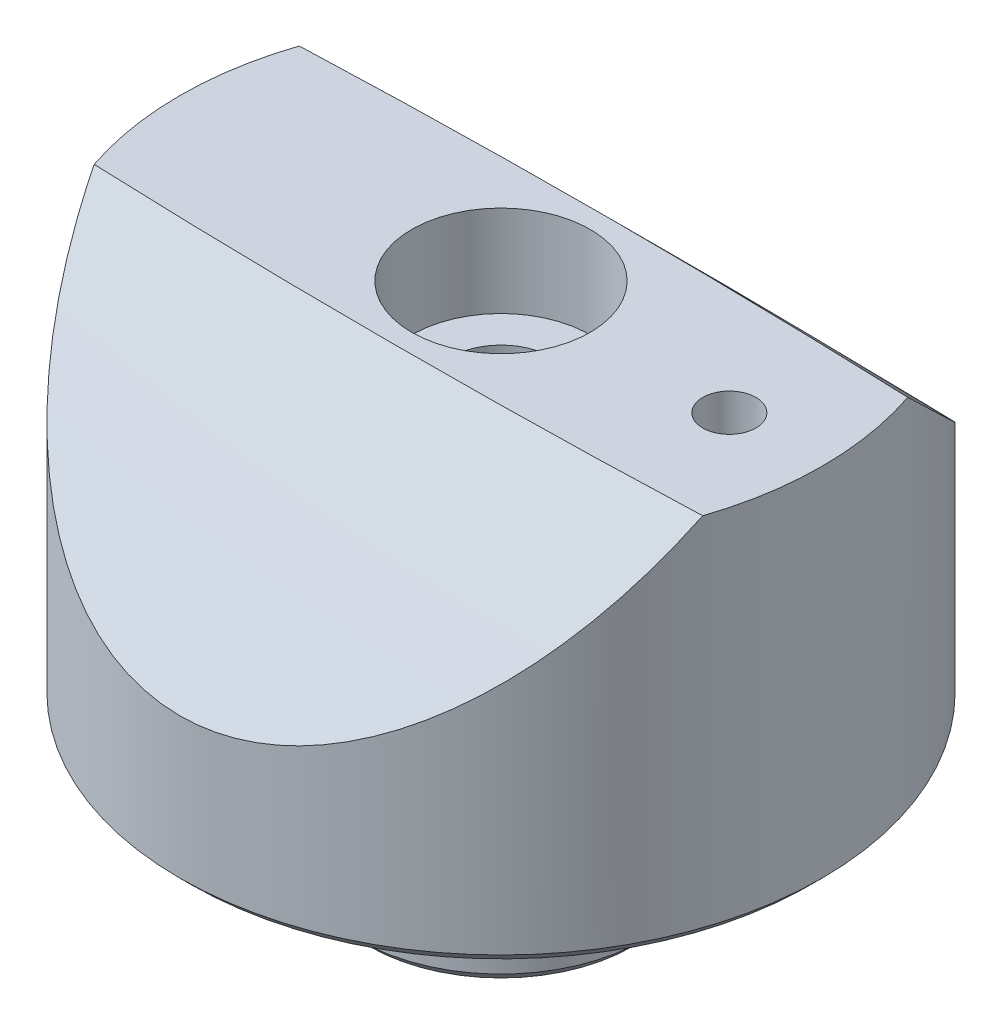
ISO-10303-21;
HEADER;
FILE_DESCRIPTION(('STEP AP214'),'2;1');
FILE_NAME('part.step','',(''),(''),'','','');
FILE_SCHEMA(('AUTOMOTIVE_DESIGN { 1 0 10303 214 1 1 1 1 }'));
ENDSEC;
DATA;
#1=APPLICATION_CONTEXT('core data for automotive mechanical design processes');
#2=APPLICATION_PROTOCOL_DEFINITION('international standard','automotive_design',2000,#1);
#3=PRODUCT_CONTEXT('',#1,'mechanical');
#4=PRODUCT('Part','Part','',(#3));
#5=PRODUCT_RELATED_PRODUCT_CATEGORY('part','',(#4));
#6=PRODUCT_DEFINITION_FORMATION('','',#4);
#7=PRODUCT_DEFINITION_CONTEXT('part definition',#1,'design');
#8=PRODUCT_DEFINITION('design','',#6,#7);
#9=PRODUCT_DEFINITION_SHAPE('','',#8);
#10=(LENGTH_UNIT() NAMED_UNIT(*) SI_UNIT(.MILLI.,.METRE.));
#11=(NAMED_UNIT(*) PLANE_ANGLE_UNIT() SI_UNIT($,.RADIAN.));
#12=(NAMED_UNIT(*) SI_UNIT($,.STERADIAN.) SOLID_ANGLE_UNIT());
#13=UNCERTAINTY_MEASURE_WITH_UNIT(LENGTH_MEASURE(1.E-05),#10,'distance_accuracy_value','');
#14=(GEOMETRIC_REPRESENTATION_CONTEXT(3) GLOBAL_UNCERTAINTY_ASSIGNED_CONTEXT((#13)) GLOBAL_UNIT_ASSIGNED_CONTEXT((#10,
#11,#12)) REPRESENTATION_CONTEXT('',''));
#15=CARTESIAN_POINT('',(0.,0.,0.));
#16=DIRECTION('',(0.,0.,1.));
#17=DIRECTION('',(1.,0.,0.));
#18=AXIS2_PLACEMENT_3D('',#15,#16,#17);
#19=CARTESIAN_POINT('',(0.,-339.071198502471,346.818198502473));
#20=DIRECTION('',(0.,1.,0.));
#21=DIRECTION('',(-0.0784590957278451,0.,-0.996917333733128));
#22=AXIS2_PLACEMENT_3D('',#19,#20,#21);
#23=SPHERICAL_SURFACE('',#22,500.);
#24=CARTESIAN_POINT('',(13.539175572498,16.38309999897,-4.56326430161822));
#25=CARTESIAN_POINT('',(13.4687356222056,16.1791994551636,-4.77224234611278));
#26=CARTESIAN_POINT('',(13.3932476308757,15.9760747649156,-4.98024497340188));
#27=CARTESIAN_POINT('',(13.2320148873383,15.5716291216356,-5.3940511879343));
#28=CARTESIAN_POINT('',(13.1462692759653,15.3703083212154,-5.59985458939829));
#29=CARTESIAN_POINT('',(12.8731737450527,14.7689300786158,-6.21410393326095));
#30=CARTESIAN_POINT('',(12.6701580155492,14.372019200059,-6.61881265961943));
#31=CARTESIAN_POINT('',(12.2187270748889,13.5854757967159,-7.41949382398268));
#32=CARTESIAN_POINT('',(11.9698508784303,13.195965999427,-7.81532710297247));
#33=CARTESIAN_POINT('',(11.4266271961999,12.432427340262,-8.59002077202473));
#34=CARTESIAN_POINT('',(11.1323106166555,12.0583881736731,-8.96889247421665));
#35=CARTESIAN_POINT('',(10.5844602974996,11.4310055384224,-9.60341611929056));
#36=CARTESIAN_POINT('',(10.3421961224,11.1729175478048,-9.86414097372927));
#37=CARTESIAN_POINT('',(9.83220630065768,10.6691080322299,-10.3725611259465));
#38=CARTESIAN_POINT('',(9.56447676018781,10.423388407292,-10.6202544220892));
#39=CARTESIAN_POINT('',(9.00405767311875,9.94766162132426,-11.0993255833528));
#40=CARTESIAN_POINT('',(8.71145869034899,9.71760251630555,-11.3307574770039));
#41=CARTESIAN_POINT('',(8.1002233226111,9.27511695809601,-11.7754748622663));
#42=CARTESIAN_POINT('',(7.78159117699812,9.06268764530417,-11.9887632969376));
#43=CARTESIAN_POINT('',(7.18849308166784,8.70140902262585,-12.3512022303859));
#44=CARTESIAN_POINT('',(6.91889761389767,8.54860297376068,-12.5043889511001));
#45=CARTESIAN_POINT('',(6.36411010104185,8.25788485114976,-12.7956571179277));
#46=CARTESIAN_POINT('',(6.07892585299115,8.11996543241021,-12.9337460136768));
#47=CARTESIAN_POINT('',(5.49354111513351,7.8608593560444,-13.1930339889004));
#48=CARTESIAN_POINT('',(5.19333785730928,7.73967579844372,-13.3142299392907));
#49=CARTESIAN_POINT('',(4.57917163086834,7.51608164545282,-13.537747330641));
#50=CARTESIAN_POINT('',(4.26520892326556,7.41367069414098,-13.6400691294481));
#51=CARTESIAN_POINT('',(3.63264522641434,7.23171072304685,-13.8218059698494));
#52=CARTESIAN_POINT('',(3.31431636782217,7.15169065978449,-13.901693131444));
#53=CARTESIAN_POINT('',(2.66841667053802,7.01313057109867,-14.0399877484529));
#54=CARTESIAN_POINT('',(2.34084613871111,6.95458983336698,-14.0983959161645));
#55=CARTESIAN_POINT('',(1.67942577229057,6.86037707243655,-14.1923806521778));
#56=CARTESIAN_POINT('',(1.34558071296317,6.82468832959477,-14.2279739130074));
#57=CARTESIAN_POINT('',(0.674527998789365,6.77700129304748,-14.2755308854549));
#58=CARTESIAN_POINT('',(0.337320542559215,6.76500160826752,-14.2874959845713));
#59=CARTESIAN_POINT('',(-0.318941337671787,6.76499373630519,-14.2875037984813));
#60=CARTESIAN_POINT('',(-0.6379970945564,6.77573044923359,-14.2767979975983));
#61=CARTESIAN_POINT('',(-1.27324263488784,6.81843170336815,-14.2342136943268));
#62=CARTESIAN_POINT('',(-1.58943253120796,6.85039540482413,-14.2023360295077));
#63=CARTESIAN_POINT('',(-2.21639941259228,6.93485409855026,-14.1180853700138));
#64=CARTESIAN_POINT('',(-2.52717412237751,6.98735751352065,-14.0657039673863));
#65=CARTESIAN_POINT('',(-3.1408303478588,7.11179604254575,-13.9415156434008));
#66=CARTESIAN_POINT('',(-3.4437115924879,7.18373182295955,-13.8697080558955));
#67=CARTESIAN_POINT('',(-4.03767261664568,7.34512876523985,-13.7085355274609));
#68=CARTESIAN_POINT('',(-4.3288165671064,7.43447236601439,-13.619288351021));
#69=CARTESIAN_POINT('',(-4.89989042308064,7.62947211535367,-13.4244094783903));
#70=CARTESIAN_POINT('',(-5.17982066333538,7.73512777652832,-13.3187782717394));
#71=CARTESIAN_POINT('',(-5.72729916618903,7.96115565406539,-13.0926844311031));
#72=CARTESIAN_POINT('',(-5.99485226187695,8.08152205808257,-12.9722276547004));
#73=CARTESIAN_POINT('',(-6.51708539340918,8.33552377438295,-12.717887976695));
#74=CARTESIAN_POINT('',(-6.77175925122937,8.46916536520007,-12.5839987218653));
#75=CARTESIAN_POINT('',(-7.37014214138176,8.80587990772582,-12.246447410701));
#76=CARTESIAN_POINT('',(-7.70719191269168,9.014835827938,-12.0368036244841));
#77=CARTESIAN_POINT('',(-8.35410304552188,9.45257787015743,-11.5971852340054));
#78=CARTESIAN_POINT('',(-8.66395287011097,9.68137232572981,-11.3672020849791));
#79=CARTESIAN_POINT('',(-9.25792979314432,10.1566386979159,-10.8889599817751));
#80=CARTESIAN_POINT('',(-9.54192759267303,10.4031894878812,-10.6406193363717));
#81=CARTESIAN_POINT('',(-10.0829470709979,10.9101267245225,-10.1294292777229));
#82=CARTESIAN_POINT('',(-10.3399737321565,11.1705106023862,-9.86658255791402));
#83=CARTESIAN_POINT('',(-10.9332711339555,11.8178904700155,-9.21231475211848));
#84=CARTESIAN_POINT('',(-11.2557974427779,12.2109817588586,-8.81441031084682));
#85=CARTESIAN_POINT('',(-11.8494046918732,13.015418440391,-7.99868755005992));
#86=CARTESIAN_POINT('',(-12.1204408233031,13.4267793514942,-7.58085227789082));
#87=CARTESIAN_POINT('',(-12.6095340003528,14.2574880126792,-6.73553748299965));
#88=CARTESIAN_POINT('',(-12.8282526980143,14.6766547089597,-6.30826240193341));
#89=CARTESIAN_POINT('',(-13.1210411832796,15.3121912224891,-5.6592510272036));
#90=CARTESIAN_POINT('',(-13.212690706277,15.5249779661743,-5.44175865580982));
#91=CARTESIAN_POINT('',(-13.3845001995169,15.952587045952,-5.00429614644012));
#92=CARTESIAN_POINT('',(-13.464661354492,16.1674091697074,-4.78432626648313));
#93=CARTESIAN_POINT('',(-13.5391755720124,16.3830999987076,-4.5632643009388));
#94=B_SPLINE_CURVE_WITH_KNOTS('',3,(#24,#25,#26,#27,#28,#29,#30,#31,#32,#33,#34,#35,#36,#37,#38,
#39,#40,#41,#42,#43,#44,#45,#46,#47,#48,#49,#50,#51,#52,#53,#54,#55,#56,#57,#58,#59,#60,#61,#62,
#63,#64,#65,#66,#67,#68,#69,#70,#71,#72,#73,#74,#75,#76,#77,#78,#79,#80,#81,#82,#83,#84,#85,#86,
#87,#88,#89,#90,#91,#92,#93),.UNSPECIFIED.,.F.,.F.,(4,2,2,2,2,2,2,2,2,2,2,2,2,2,2,2,2,2,2,2,2,2,
2,2,2,2,2,2,2,2,2,2,2,2,4),(0.,0.900951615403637,1.80197874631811,3.60651146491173,
5.43028474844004,7.25282301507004,8.57075982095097,9.8888984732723,11.2024273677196,
12.5157427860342,13.5518944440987,14.5875325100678,15.6233621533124,16.6591721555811,
17.671193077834,18.6831804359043,19.6944265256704,20.705613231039,21.6624386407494,
22.6192262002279,23.5764065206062,24.5336196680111,25.4845794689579,26.4355108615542,
27.3860677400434,28.3370763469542,29.6807834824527,31.0250578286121,32.375723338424,
33.7261388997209,35.6600335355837,37.5956034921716,39.5052198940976,40.4583554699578,
41.4113926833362),.UNSPECIFIED.);
#95=CARTESIAN_POINT('',(13.5391410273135,16.383,-4.56336679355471));
#96=VERTEX_POINT('',#95);
#97=CARTESIAN_POINT('',(-13.5391410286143,16.3829999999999,-4.56336678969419));
#98=VERTEX_POINT('',#97);
#99=EDGE_CURVE('E69',#96,#98,#94,.T.);
#100=ORIENTED_EDGE('',*,*,#99,.T.);
#101=CARTESIAN_POINT('',(0.,16.383,346.818198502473));
#102=DIRECTION('',(0.,-1.,0.));
#103=DIRECTION('',(0.,0.,-1.));
#104=AXIS2_PLACEMENT_3D('',#101,#102,#103);
#105=CIRCLE('',#104,351.64230798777);
#106=EDGE_CURVE('E78',#98,#96,#105,.T.);
#107=ORIENTED_EDGE('',*,*,#106,.T.);
#108=EDGE_LOOP('',(#100,#107));
#109=FACE_BOUND('',#108,.T.);
#110=ADVANCED_FACE('F43',(#109),#23,.T.);
#111=CARTESIAN_POINT('',(-25.4,16.383,7.9375));
#112=DIRECTION('',(0.,-1.,0.));
#113=DIRECTION('',(0.,0.,-1.));
#114=AXIS2_PLACEMENT_3D('',#111,#112,#113);
#115=PLANE('',#114);
#116=CARTESIAN_POINT('',(10.16,16.383,0.));
#117=DIRECTION('',(0.,1.,0.));
#118=DIRECTION('',(0.,0.,1.));
#119=AXIS2_PLACEMENT_3D('',#116,#117,#118);
#120=CIRCLE('',#119,1.1811);
#121=CARTESIAN_POINT('',(10.16,16.383,1.1811));
#122=VERTEX_POINT('',#121);
#123=EDGE_CURVE('E189',#122,#122,#120,.T.);
#124=ORIENTED_EDGE('',*,*,#123,.F.);
#125=EDGE_LOOP('',(#124));
#126=FACE_BOUND('',#125,.T.);
#127=CARTESIAN_POINT('',(0.,16.383,0.));
#128=DIRECTION('',(0.,1.,0.));
#129=DIRECTION('',(0.,0.,1.));
#130=AXIS2_PLACEMENT_3D('',#127,#128,#129);
#131=CIRCLE('',#130,3.97);
#132=CARTESIAN_POINT('',(0.,16.383,3.97));
#133=VERTEX_POINT('',#132);
#134=EDGE_CURVE('E105',#133,#133,#131,.T.);
#135=ORIENTED_EDGE('',*,*,#134,.F.);
#136=EDGE_LOOP('',(#135));
#137=FACE_BOUND('',#136,.T.);
#138=CARTESIAN_POINT('',(0.,16.383,0.));
#139=DIRECTION('',(0.,1.,0.));
#140=DIRECTION('',(0.,0.,1.));
#141=AXIS2_PLACEMENT_3D('',#138,#139,#140);
#142=CIRCLE('',#141,14.2875);
#143=CARTESIAN_POINT('',(-13.5391410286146,16.3829999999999,4.5633667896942));
#144=VERTEX_POINT('',#143);
#145=EDGE_CURVE('E75',#98,#144,#142,.T.);
#146=ORIENTED_EDGE('',*,*,#145,.T.);
#147=CARTESIAN_POINT('',(0.,16.383,-346.818198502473));
#148=DIRECTION('',(0.,1.,0.));
#149=DIRECTION('',(0.,0.,1.));
#150=AXIS2_PLACEMENT_3D('',#147,#148,#149);
#151=CIRCLE('',#150,351.64230798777);
#152=CARTESIAN_POINT('',(13.5391410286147,16.383,4.56336678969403));
#153=VERTEX_POINT('',#152);
#154=EDGE_CURVE('E85',#144,#153,#151,.T.);
#155=ORIENTED_EDGE('',*,*,#154,.T.);
#156=EDGE_CURVE('E73',#153,#96,#142,.T.);
#157=ORIENTED_EDGE('',*,*,#156,.T.);
#158=ORIENTED_EDGE('',*,*,#106,.F.);
#159=EDGE_LOOP('',(#146,#155,#157,#158));
#160=FACE_BOUND('',#159,.T.);
#161=ADVANCED_FACE('F83',(#126,#137,#160),#115,.F.);
#162=CARTESIAN_POINT('',(0.,-19.9423816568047,0.));
#163=DIRECTION('',(0.,1.,0.));
#164=DIRECTION('',(0.,0.,1.));
#165=AXIS2_PLACEMENT_3D('',#162,#163,#164);
#166=CYLINDRICAL_SURFACE('',#165,14.2875);
#167=CARTESIAN_POINT('',(0.,0.508000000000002,0.));
#168=DIRECTION('',(0.,1.,0.));
#169=DIRECTION('',(0.,0.,1.));
#170=AXIS2_PLACEMENT_3D('',#167,#168,#169);
#171=CIRCLE('',#170,14.2875);
#172=CARTESIAN_POINT('',(0.,0.508000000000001,14.2875));
#173=VERTEX_POINT('',#172);
#174=EDGE_CURVE('E179',#173,#173,#171,.T.);
#175=ORIENTED_EDGE('',*,*,#174,.T.);
#176=EDGE_LOOP('',(#175));
#177=FACE_BOUND('',#176,.T.);
#178=ORIENTED_EDGE('',*,*,#156,.F.);
#179=CARTESIAN_POINT('',(13.5391806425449,16.3831146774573,4.56324925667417));
#180=CARTESIAN_POINT('',(13.4687409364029,16.1792140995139,4.77222734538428));
#181=CARTESIAN_POINT('',(13.3932531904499,15.9760893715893,4.98023002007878));
#182=CARTESIAN_POINT('',(13.232020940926,15.5716436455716,5.39403633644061));
#183=CARTESIAN_POINT('',(13.146275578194,15.3703228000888,5.59983979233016));
#184=CARTESIAN_POINT('',(12.8731808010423,14.7689444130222,6.21408930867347));
#185=CARTESIAN_POINT('',(12.6701655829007,14.3720334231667,6.61879816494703));
#186=CARTESIAN_POINT('',(12.2187356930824,13.5854897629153,7.41947962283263));
#187=CARTESIAN_POINT('',(11.9698600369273,13.1959798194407,7.81531306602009));
#188=CARTESIAN_POINT('',(11.4266374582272,12.4324408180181,8.59000711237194));
#189=CARTESIAN_POINT('',(11.1323214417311,12.0584014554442,8.96887902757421));
#190=CARTESIAN_POINT('',(10.584471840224,11.4310181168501,9.60340340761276));
#191=CARTESIAN_POINT('',(10.3422077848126,11.1729296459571,9.86412875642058));
#192=CARTESIAN_POINT('',(9.8322181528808,10.6691191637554,10.3725499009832));
#193=CARTESIAN_POINT('',(9.56448868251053,10.4233990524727,10.620243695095));
#194=CARTESIAN_POINT('',(9.0040696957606,9.94767130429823,11.099315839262));
#195=CARTESIAN_POINT('',(8.71147074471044,9.71761172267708,11.330748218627));
#196=CARTESIAN_POINT('',(8.10023538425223,9.27512521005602,11.7754665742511));
#197=CARTESIAN_POINT('',(7.78160321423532,9.06269541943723,11.988755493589));
#198=CARTESIAN_POINT('',(7.18850515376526,8.70141602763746,12.3511952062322));
#199=CARTESIAN_POINT('',(6.91890976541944,8.5486096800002,12.504382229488));
#200=CARTESIAN_POINT('',(6.36412238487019,8.25789094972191,12.7956510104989));
#201=CARTESIAN_POINT('',(6.0789381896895,8.11997122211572,12.9337402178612));
#202=CARTESIAN_POINT('',(5.49355345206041,7.86086448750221,13.193028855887));
#203=CARTESIAN_POINT('',(5.19335013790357,7.73968058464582,13.314225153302));
#204=CARTESIAN_POINT('',(4.57918374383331,7.51608574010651,13.5377432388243));
#205=CARTESIAN_POINT('',(4.26522092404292,7.41367444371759,13.6400653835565));
#206=CARTESIAN_POINT('',(3.63263678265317,7.23170800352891,13.821808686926));
#207=CARTESIAN_POINT('',(3.3142868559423,7.1516830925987,13.9017006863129));
#208=CARTESIAN_POINT('',(2.66834392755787,7.01311620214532,14.0400020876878));
#209=CARTESIAN_POINT('',(2.34075123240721,6.95457351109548,14.0984122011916));
#210=CARTESIAN_POINT('',(1.67928610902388,6.86035998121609,14.1923976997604));
#211=CARTESIAN_POINT('',(1.34541845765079,6.82467241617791,14.2279897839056));
#212=CARTESIAN_POINT('',(0.674320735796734,6.77699094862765,14.2755412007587));
#213=CARTESIAN_POINT('',(0.337090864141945,6.76499565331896,14.2875019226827));
#214=CARTESIAN_POINT('',(-0.319196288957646,6.7649993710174,14.2874981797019));
#215=CARTESIAN_POINT('',(-0.638254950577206,6.77574194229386,14.2767865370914));
#216=CARTESIAN_POINT('',(-1.27350546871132,6.81845521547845,14.2341902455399));
#217=CARTESIAN_POINT('',(-1.58969743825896,6.85042507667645,14.2023064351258));
#218=CARTESIAN_POINT('',(-2.21666762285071,6.93489625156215,14.1180433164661));
#219=CARTESIAN_POINT('',(-2.5274435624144,6.9874059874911,14.0656556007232));
#220=CARTESIAN_POINT('',(-3.14110145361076,7.11185718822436,13.9414546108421));
#221=CARTESIAN_POINT('',(-3.44398313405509,7.1837993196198,13.8696406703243));
#222=CARTESIAN_POINT('',(-4.03794416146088,7.34520880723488,13.7084555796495));
#223=CARTESIAN_POINT('',(-4.32908768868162,7.43455859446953,13.6192022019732));
#224=CARTESIAN_POINT('',(-4.9001600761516,7.6295705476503,13.4243110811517));
#225=CARTESIAN_POINT('',(-5.18008927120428,7.73523222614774,13.3186738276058));
#226=CARTESIAN_POINT('',(-5.72756516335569,7.96127192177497,13.0925680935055));
#227=CARTESIAN_POINT('',(-5.99511669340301,8.08164412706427,12.972105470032));
#228=CARTESIAN_POINT('',(-6.51734624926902,8.33565720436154,12.7177543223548));
#229=CARTESIAN_POINT('',(-6.77201809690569,8.46930435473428,12.5838594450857));
#230=CARTESIAN_POINT('',(-7.37040032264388,8.80603461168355,12.2462922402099));
#231=CARTESIAN_POINT('',(-7.70745090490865,9.01500087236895,12.0366379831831));
#232=CARTESIAN_POINT('',(-8.35436237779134,9.45276357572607,11.5969986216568));
#233=CARTESIAN_POINT('',(-8.66421173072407,9.68156835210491,11.3670049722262));
#234=CARTESIAN_POINT('',(-9.25818648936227,10.1568552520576,10.8887419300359));
#235=CARTESIAN_POINT('',(-9.54218259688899,10.403416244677,10.6403908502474));
#236=CARTESIAN_POINT('',(-10.0831976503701,10.910373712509,10.1291800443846));
#237=CARTESIAN_POINT('',(-10.3402215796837,11.1707676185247,9.86632301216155));
#238=CARTESIAN_POINT('',(-10.9334835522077,11.8181414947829,9.21206076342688));
#239=CARTESIAN_POINT('',(-11.2559808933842,12.2112147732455,8.81417427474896));
#240=CARTESIAN_POINT('',(-11.8495363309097,13.0156124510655,7.99849056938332));
#241=CARTESIAN_POINT('',(-12.1205496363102,13.4269523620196,7.58067640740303));
#242=CARTESIAN_POINT('',(-12.6096034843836,14.2576176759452,6.73540536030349));
#243=CARTESIAN_POINT('',(-12.8283055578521,14.6767620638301,6.30815287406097));
#244=CARTESIAN_POINT('',(-13.1210731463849,15.3122642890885,5.65917635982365));
#245=CARTESIAN_POINT('',(-13.2127163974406,15.525039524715,5.44169570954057));
#246=CARTESIAN_POINT('',(-13.3845146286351,15.9526253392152,5.00425693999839));
#247=CARTESIAN_POINT('',(-13.4646707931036,16.1674357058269,4.78429907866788));
#248=CARTESIAN_POINT('',(-13.5391806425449,16.3831146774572,4.56324925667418));
#249=B_SPLINE_CURVE_WITH_KNOTS('',3,(#179,#180,#181,#182,#183,#184,#185,#186,#187,#188,#189,
#190,#191,#192,#193,#194,#195,#196,#197,#198,#199,#200,#201,#202,#203,#204,#205,#206,#207,#208,
#209,#210,#211,#212,#213,#214,#215,#216,#217,#218,#219,#220,#221,#222,#223,#224,#225,#226,#227,
#228,#229,#230,#231,#232,#233,#234,#235,#236,#237,#238,#239,#240,#241,#242,#243,#244,#245,#246,
#247,#248),.UNSPECIFIED.,.F.,.F.,(4,2,2,2,2,2,2,2,2,2,2,2,2,2,2,2,2,2,2,2,2,2,2,2,2,2,2,2,2,2,2,
2,2,2,4),(0.,0.900951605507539,1.80197872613,3.6065114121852,5.43028463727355,7.25282285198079,
8.57076118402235,9.88890136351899,11.20243171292,12.5157485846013,13.5519008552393,
14.5875395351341,15.6233700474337,16.6591809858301,17.6712680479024,18.6833215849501,
19.694633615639,20.7058861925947,21.6627214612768,22.6195188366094,23.5767089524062,
24.533931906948,25.4849010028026,26.4358416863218,27.3864078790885,28.3374258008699,
29.681163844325,31.0254691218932,32.3761654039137,33.7266116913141,35.6603975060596,
37.5958580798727,39.5053682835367,40.4584512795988,41.4114359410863),.UNSPECIFIED.);
#250=EDGE_CURVE('E61',#153,#144,#249,.T.);
#251=ORIENTED_EDGE('',*,*,#250,.T.);
#252=ORIENTED_EDGE('',*,*,#145,.F.);
#253=ORIENTED_EDGE('',*,*,#99,.F.);
#254=EDGE_LOOP('',(#178,#251,#252,#253));
#255=FACE_BOUND('',#254,.T.);
#256=ADVANCED_FACE('F71',(#177,#255),#166,.T.);
#257=CARTESIAN_POINT('',(6.35,0.,0.));
#258=DIRECTION('',(0.,1.,0.));
#259=DIRECTION('',(0.,0.,1.));
#260=AXIS2_PLACEMENT_3D('',#257,#258,#259);
#261=PLANE('',#260);
#262=CARTESIAN_POINT('',(0.,0.,0.));
#263=DIRECTION('',(0.,1.,0.));
#264=DIRECTION('',(0.,0.,1.));
#265=AXIS2_PLACEMENT_3D('',#262,#263,#264);
#266=CIRCLE('',#265,13.7795);
#267=CARTESIAN_POINT('',(0.,0.,13.7795));
#268=VERTEX_POINT('',#267);
#269=EDGE_CURVE('E186',#268,#268,#266,.F.);
#270=ORIENTED_EDGE('',*,*,#269,.T.);
#271=EDGE_LOOP('',(#270));
#272=FACE_BOUND('',#271,.T.);
#273=CARTESIAN_POINT('',(0.,0.,0.));
#274=DIRECTION('',(0.,1.,0.));
#275=DIRECTION('',(0.,0.,1.));
#276=AXIS2_PLACEMENT_3D('',#273,#274,#275);
#277=CIRCLE('',#276,7.24948711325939);
#278=CARTESIAN_POINT('',(0.,0.,7.2494871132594));
#279=VERTEX_POINT('',#278);
#280=EDGE_CURVE('E192',#279,#279,#277,.T.);
#281=ORIENTED_EDGE('',*,*,#280,.T.);
#282=EDGE_LOOP('',(#281));
#283=FACE_BOUND('',#282,.T.);
#284=CARTESIAN_POINT('',(10.16,0.,0.));
#285=DIRECTION('',(0.,1.,0.));
#286=DIRECTION('',(0.,0.,1.));
#287=AXIS2_PLACEMENT_3D('',#284,#285,#286);
#288=CIRCLE('',#287,1.1811);
#289=CARTESIAN_POINT('',(10.16,0.,1.1811));
#290=VERTEX_POINT('',#289);
#291=EDGE_CURVE('E81',#290,#290,#288,.T.);
#292=ORIENTED_EDGE('',*,*,#291,.T.);
#293=EDGE_LOOP('',(#292));
#294=FACE_BOUND('',#293,.T.);
#295=ADVANCED_FACE('F127',(#272,#283,#294),#261,.F.);
#296=CARTESIAN_POINT('',(0.,-19.9423816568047,0.));
#297=DIRECTION('',(0.,1.,0.));
#298=DIRECTION('',(0.,0.,1.));
#299=AXIS2_PLACEMENT_3D('',#296,#297,#298);
#300=CYLINDRICAL_SURFACE('',#299,6.35);
#301=CARTESIAN_POINT('',(0.,-5.842,0.));
#302=DIRECTION('',(0.,1.,0.));
#303=DIRECTION('',(0.,0.,1.));
#304=AXIS2_PLACEMENT_3D('',#301,#302,#303);
#305=CIRCLE('',#304,6.35);
#306=CARTESIAN_POINT('',(0.,-5.842,6.35));
#307=VERTEX_POINT('',#306);
#308=EDGE_CURVE('E53',#307,#307,#305,.T.);
#309=ORIENTED_EDGE('',*,*,#308,.T.);
#310=EDGE_LOOP('',(#309));
#311=FACE_BOUND('',#310,.T.);
#312=CARTESIAN_POINT('',(0.,-0.803926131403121,0.));
#313=DIRECTION('',(0.,1.,0.));
#314=DIRECTION('',(0.,0.,1.));
#315=AXIS2_PLACEMENT_3D('',#312,#313,#314);
#316=CIRCLE('',#315,6.35);
#317=CARTESIAN_POINT('',(0.,-0.803926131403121,6.35));
#318=VERTEX_POINT('',#317);
#319=EDGE_CURVE('E195',#318,#318,#316,.F.);
#320=ORIENTED_EDGE('',*,*,#319,.T.);
#321=EDGE_LOOP('',(#320));
#322=FACE_BOUND('',#321,.T.);
#323=ADVANCED_FACE('F132',(#311,#322),#300,.T.);
#324=CARTESIAN_POINT('',(2.25,-6.35,0.));
#325=DIRECTION('',(0.,1.,0.));
#326=DIRECTION('',(0.,0.,1.));
#327=AXIS2_PLACEMENT_3D('',#324,#325,#326);
#328=PLANE('',#327);
#329=CARTESIAN_POINT('',(0.,-6.35,0.));
#330=DIRECTION('',(0.,-1.,0.));
#331=DIRECTION('',(0.,0.,-1.));
#332=AXIS2_PLACEMENT_3D('',#329,#330,#331);
#333=CIRCLE('',#332,3.175);
#334=CARTESIAN_POINT('',(0.,-6.35,-3.175));
#335=VERTEX_POINT('',#334);
#336=EDGE_CURVE('E202',#335,#335,#333,.T.);
#337=ORIENTED_EDGE('',*,*,#336,.F.);
#338=EDGE_LOOP('',(#337));
#339=FACE_BOUND('',#338,.T.);
#340=CARTESIAN_POINT('',(0.,-6.35,0.));
#341=DIRECTION('',(0.,1.,0.));
#342=DIRECTION('',(0.,0.,1.));
#343=AXIS2_PLACEMENT_3D('',#340,#341,#342);
#344=CIRCLE('',#343,5.842);
#345=CARTESIAN_POINT('',(0.,-6.35,5.842));
#346=VERTEX_POINT('',#345);
#347=EDGE_CURVE('E11',#346,#346,#344,.F.);
#348=ORIENTED_EDGE('',*,*,#347,.T.);
#349=EDGE_LOOP('',(#348));
#350=FACE_BOUND('',#349,.T.);
#351=ADVANCED_FACE('F136',(#339,#350),#328,.F.);
#352=CARTESIAN_POINT('',(0.,-19.9423816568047,0.));
#353=DIRECTION('',(0.,1.,0.));
#354=DIRECTION('',(0.,0.,1.));
#355=AXIS2_PLACEMENT_3D('',#352,#353,#354);
#356=CYLINDRICAL_SURFACE('',#355,2.25);
#357=CARTESIAN_POINT('',(0.,7.80188050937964,0.));
#358=DIRECTION('',(0.,-1.,0.));
#359=DIRECTION('',(0.,0.,-1.));
#360=AXIS2_PLACEMENT_3D('',#357,#358,#359);
#361=CIRCLE('',#360,2.25);
#362=CARTESIAN_POINT('',(0.,7.80188050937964,-2.25));
#363=VERTEX_POINT('',#362);
#364=EDGE_CURVE('E47',#363,#363,#361,.T.);
#365=ORIENTED_EDGE('',*,*,#364,.T.);
#366=EDGE_LOOP('',(#365));
#367=FACE_BOUND('',#366,.T.);
#368=CARTESIAN_POINT('',(0.,12.319,0.));
#369=DIRECTION('',(0.,1.,0.));
#370=DIRECTION('',(0.,0.,1.));
#371=AXIS2_PLACEMENT_3D('',#368,#369,#370);
#372=CIRCLE('',#371,2.25);
#373=CARTESIAN_POINT('',(0.,12.319,2.25));
#374=VERTEX_POINT('',#373);
#375=EDGE_CURVE('E95',#374,#374,#372,.T.);
#376=ORIENTED_EDGE('',*,*,#375,.T.);
#377=EDGE_LOOP('',(#376));
#378=FACE_BOUND('',#377,.T.);
#379=ADVANCED_FACE('F140',(#367,#378),#356,.F.);
#380=CARTESIAN_POINT('',(2.25,12.319,0.));
#381=DIRECTION('',(0.,-1.,0.));
#382=DIRECTION('',(0.,0.,-1.));
#383=AXIS2_PLACEMENT_3D('',#380,#381,#382);
#384=PLANE('',#383);
#385=ORIENTED_EDGE('',*,*,#375,.F.);
#386=EDGE_LOOP('',(#385));
#387=FACE_BOUND('',#386,.T.);
#388=CARTESIAN_POINT('',(0.,12.319,0.));
#389=DIRECTION('',(0.,1.,0.));
#390=DIRECTION('',(0.,0.,1.));
#391=AXIS2_PLACEMENT_3D('',#388,#389,#390);
#392=CIRCLE('',#391,3.97);
#393=CARTESIAN_POINT('',(0.,12.319,3.97));
#394=VERTEX_POINT('',#393);
#395=EDGE_CURVE('E101',#394,#394,#392,.T.);
#396=ORIENTED_EDGE('',*,*,#395,.T.);
#397=EDGE_LOOP('',(#396));
#398=FACE_BOUND('',#397,.T.);
#399=ADVANCED_FACE('F144',(#387,#398),#384,.F.);
#400=CARTESIAN_POINT('',(0.,-19.9423816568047,0.));
#401=DIRECTION('',(0.,1.,0.));
#402=DIRECTION('',(0.,0.,1.));
#403=AXIS2_PLACEMENT_3D('',#400,#401,#402);
#404=CYLINDRICAL_SURFACE('',#403,3.97);
#405=ORIENTED_EDGE('',*,*,#395,.F.);
#406=EDGE_LOOP('',(#405));
#407=FACE_BOUND('',#406,.T.);
#408=ORIENTED_EDGE('',*,*,#134,.T.);
#409=EDGE_LOOP('',(#408));
#410=FACE_BOUND('',#409,.T.);
#411=ADVANCED_FACE('F148',(#407,#410),#404,.F.);
#412=CARTESIAN_POINT('',(0.,-339.071198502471,-346.818198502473));
#413=DIRECTION('',(0.,1.,0.));
#414=DIRECTION('',(-0.0784590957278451,0.,0.996917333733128));
#415=AXIS2_PLACEMENT_3D('',#412,#413,#414);
#416=SPHERICAL_SURFACE('',#415,500.);
#417=ORIENTED_EDGE('',*,*,#250,.F.);
#418=ORIENTED_EDGE('',*,*,#154,.F.);
#419=EDGE_LOOP('',(#417,#418));
#420=FACE_BOUND('',#419,.T.);
#421=ADVANCED_FACE('F121',(#420),#416,.T.);
#422=CARTESIAN_POINT('',(10.16,-6.35,0.));
#423=DIRECTION('',(0.,1.,0.));
#424=DIRECTION('',(0.,0.,1.));
#425=AXIS2_PLACEMENT_3D('',#422,#423,#424);
#426=CYLINDRICAL_SURFACE('',#425,1.1811);
#427=ORIENTED_EDGE('',*,*,#123,.T.);
#428=EDGE_LOOP('',(#427));
#429=FACE_BOUND('',#428,.T.);
#430=ORIENTED_EDGE('',*,*,#291,.F.);
#431=EDGE_LOOP('',(#430));
#432=FACE_BOUND('',#431,.T.);
#433=ADVANCED_FACE('F157',(#429,#432),#426,.F.);
#434=CARTESIAN_POINT('',(0.,-0.254000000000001,0.));
#435=DIRECTION('',(0.,1.,0.));
#436=DIRECTION('',(0.,0.,1.));
#437=AXIS2_PLACEMENT_3D('',#434,#435,#436);
#438=TOROIDAL_SURFACE('',#437,6.6675,0.635000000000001);
#439=ORIENTED_EDGE('',*,*,#319,.F.);
#440=EDGE_LOOP('',(#439));
#441=FACE_BOUND('',#440,.T.);
#442=ORIENTED_EDGE('',*,*,#280,.F.);
#443=EDGE_LOOP('',(#442));
#444=FACE_BOUND('',#443,.T.);
#445=ADVANCED_FACE('F160',(#441,#444),#438,.F.);
#446=CARTESIAN_POINT('',(0.,0.508000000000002,0.));
#447=DIRECTION('',(0.,1.,0.));
#448=DIRECTION('',(0.,0.,1.));
#449=AXIS2_PLACEMENT_3D('',#446,#447,#448);
#450=CONICAL_SURFACE('',#449,14.2875,0.785398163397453);
#451=ORIENTED_EDGE('',*,*,#269,.F.);
#452=EDGE_LOOP('',(#451));
#453=FACE_BOUND('',#452,.T.);
#454=ORIENTED_EDGE('',*,*,#174,.F.);
#455=EDGE_LOOP('',(#454));
#456=FACE_BOUND('',#455,.T.);
#457=ADVANCED_FACE('F158',(#453,#456),#450,.T.);
#458=CARTESIAN_POINT('',(0.,-5.842,0.));
#459=DIRECTION('',(0.,1.,0.));
#460=DIRECTION('',(0.,0.,1.));
#461=AXIS2_PLACEMENT_3D('',#458,#459,#460);
#462=CONICAL_SURFACE('',#461,6.35,0.785398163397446);
#463=ORIENTED_EDGE('',*,*,#347,.F.);
#464=EDGE_LOOP('',(#463));
#465=FACE_BOUND('',#464,.T.);
#466=ORIENTED_EDGE('',*,*,#308,.F.);
#467=EDGE_LOOP('',(#466));
#468=FACE_BOUND('',#467,.T.);
#469=ADVANCED_FACE('F45',(#465,#468),#462,.T.);
#470=CARTESIAN_POINT('',(0.,7.62,0.));
#471=DIRECTION('',(0.,-1.,0.));
#472=DIRECTION('',(0.,0.,-1.));
#473=AXIS2_PLACEMENT_3D('',#470,#471,#472);
#474=CONICAL_SURFACE('',#473,2.5527,1.02974425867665);
#475=CARTESIAN_POINT('',(0.,7.62,0.));
#476=DIRECTION('',(0.,-1.,0.));
#477=DIRECTION('',(0.,0.,-1.));
#478=AXIS2_PLACEMENT_3D('',#475,#476,#477);
#479=CIRCLE('',#478,2.5527);
#480=CARTESIAN_POINT('',(0.,7.62,-2.5527));
#481=VERTEX_POINT('',#480);
#482=EDGE_CURVE('E196',#481,#481,#479,.T.);
#483=ORIENTED_EDGE('',*,*,#482,.T.);
#484=EDGE_LOOP('',(#483));
#485=FACE_BOUND('',#484,.T.);
#486=ORIENTED_EDGE('',*,*,#364,.F.);
#487=EDGE_LOOP('',(#486));
#488=FACE_BOUND('',#487,.T.);
#489=ADVANCED_FACE('F166',(#485,#488),#474,.F.);
#490=CARTESIAN_POINT('',(0.,-6.35,0.));
#491=DIRECTION('',(0.,-1.,0.));
#492=DIRECTION('',(0.,0.,-1.));
#493=AXIS2_PLACEMENT_3D('',#490,#491,#492);
#494=CYLINDRICAL_SURFACE('',#493,2.5527);
#495=ORIENTED_EDGE('',*,*,#482,.F.);
#496=EDGE_LOOP('',(#495));
#497=FACE_BOUND('',#496,.T.);
#498=CARTESIAN_POINT('',(0.,-5.27214478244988,0.));
#499=DIRECTION('',(0.,-1.,0.));
#500=DIRECTION('',(0.,0.,-1.));
#501=AXIS2_PLACEMENT_3D('',#498,#499,#500);
#502=CIRCLE('',#501,2.5527);
#503=CARTESIAN_POINT('',(0.,-5.27214478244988,-2.5527));
#504=VERTEX_POINT('',#503);
#505=EDGE_CURVE('E199',#504,#504,#502,.T.);
#506=ORIENTED_EDGE('',*,*,#505,.T.);
#507=EDGE_LOOP('',(#506));
#508=FACE_BOUND('',#507,.T.);
#509=ADVANCED_FACE('F227',(#497,#508),#494,.F.);
#510=CARTESIAN_POINT('',(0.,-6.35,0.));
#511=DIRECTION('',(0.,-1.,0.));
#512=DIRECTION('',(0.,0.,-1.));
#513=AXIS2_PLACEMENT_3D('',#510,#511,#512);
#514=CONICAL_SURFACE('',#513,3.175,0.523598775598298);
#515=ORIENTED_EDGE('',*,*,#505,.F.);
#516=EDGE_LOOP('',(#515));
#517=FACE_BOUND('',#516,.T.);
#518=ORIENTED_EDGE('',*,*,#336,.T.);
#519=EDGE_LOOP('',(#518));
#520=FACE_BOUND('',#519,.T.);
#521=ADVANCED_FACE('F206',(#517,#520),#514,.F.);
#522=CLOSED_SHELL('',(#110,#161,#256,#295,#323,#351,#379,#399,#411,#421,#433,#445,#457,#469,
#489,#509,#521));
#523=MANIFOLD_SOLID_BREP('B2',#522);
#524=ADVANCED_BREP_SHAPE_REPRESENTATION('',(#18,#523),#14);
#525=SHAPE_DEFINITION_REPRESENTATION(#9,#524);
ENDSEC;
END-ISO-10303-21;
